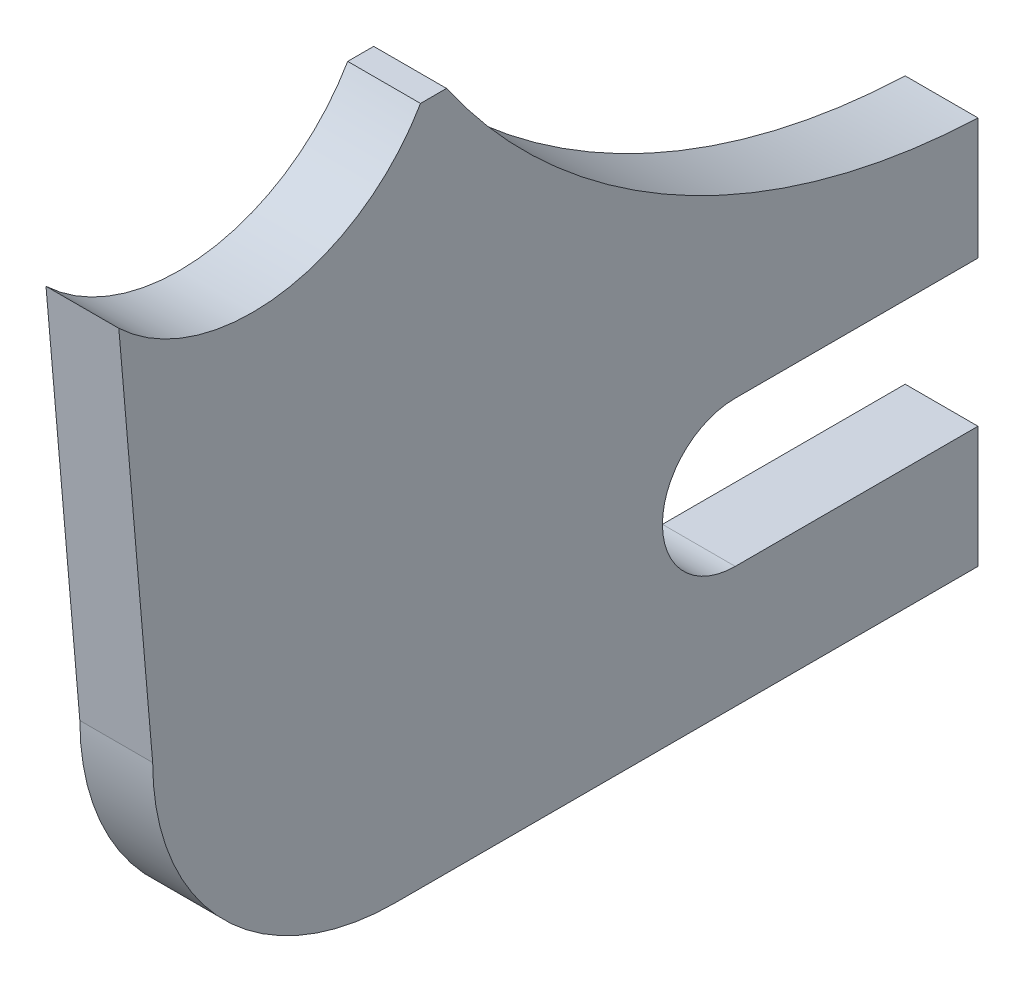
ISO-10303-21;
HEADER;
FILE_DESCRIPTION(('STEP AP214'),'2;1');
FILE_NAME('part.step','',(''),(''),'','','');
FILE_SCHEMA(('AUTOMOTIVE_DESIGN { 1 0 10303 214 1 1 1 1 }'));
ENDSEC;
DATA;
#1=APPLICATION_CONTEXT('core data for automotive mechanical design processes');
#2=APPLICATION_PROTOCOL_DEFINITION('international standard','automotive_design',2000,#1);
#3=PRODUCT_CONTEXT('',#1,'mechanical');
#4=PRODUCT('Part','Part','',(#3));
#5=PRODUCT_RELATED_PRODUCT_CATEGORY('part','',(#4));
#6=PRODUCT_DEFINITION_FORMATION('','',#4);
#7=PRODUCT_DEFINITION_CONTEXT('part definition',#1,'design');
#8=PRODUCT_DEFINITION('design','',#6,#7);
#9=PRODUCT_DEFINITION_SHAPE('','',#8);
#10=(LENGTH_UNIT() NAMED_UNIT(*) SI_UNIT(.MILLI.,.METRE.));
#11=(NAMED_UNIT(*) PLANE_ANGLE_UNIT() SI_UNIT($,.RADIAN.));
#12=(NAMED_UNIT(*) SI_UNIT($,.STERADIAN.) SOLID_ANGLE_UNIT());
#13=UNCERTAINTY_MEASURE_WITH_UNIT(LENGTH_MEASURE(1.E-05),#10,'distance_accuracy_value','');
#14=(GEOMETRIC_REPRESENTATION_CONTEXT(3) GLOBAL_UNCERTAINTY_ASSIGNED_CONTEXT((#13)) GLOBAL_UNIT_ASSIGNED_CONTEXT((#10,
#11,#12)) REPRESENTATION_CONTEXT('',''));
#15=CARTESIAN_POINT('',(0.,0.,0.));
#16=DIRECTION('',(0.,0.,1.));
#17=DIRECTION('',(1.,0.,0.));
#18=AXIS2_PLACEMENT_3D('',#15,#16,#17);
#19=CARTESIAN_POINT('',(190.5,1397.,374.32502182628));
#20=DIRECTION('',(-1.,0.,0.));
#21=DIRECTION('',(0.,0.,1.));
#22=AXIS2_PLACEMENT_3D('',#19,#20,#21);
#23=CYLINDRICAL_SURFACE('',#22,508.);
#24=CARTESIAN_POINT('',(0.,1397.,374.32502182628));
#25=DIRECTION('',(1.,0.,0.));
#26=DIRECTION('',(0.,0.,-1.));
#27=AXIS2_PLACEMENT_3D('',#24,#25,#26);
#28=CIRCLE('',#27,508.);
#29=CARTESIAN_POINT('',(0.,1028.07373018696,723.54902936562));
#30=VERTEX_POINT('',#29);
#31=CARTESIAN_POINT('',(0.,1143.,-65.6158832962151));
#32=VERTEX_POINT('',#31);
#33=EDGE_CURVE('E146',#30,#32,#28,.T.);
#34=ORIENTED_EDGE('',*,*,#33,.F.);
#35=DIRECTION('',(-1.,0.,0.));
#36=VECTOR('',#35,1.);
#37=CARTESIAN_POINT('',(190.5,1028.07373018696,723.54902936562));
#38=LINE('',#37,#36);
#39=CARTESIAN_POINT('',(190.5,1028.07373018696,723.54902936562));
#40=VERTEX_POINT('',#39);
#41=EDGE_CURVE('E11',#40,#30,#38,.T.);
#42=ORIENTED_EDGE('',*,*,#41,.F.);
#43=CARTESIAN_POINT('',(190.5,1397.,374.32502182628));
#44=DIRECTION('',(1.,0.,0.));
#45=DIRECTION('',(0.,0.,-1.));
#46=AXIS2_PLACEMENT_3D('',#43,#44,#45);
#47=CIRCLE('',#46,508.);
#48=CARTESIAN_POINT('',(190.5,1143.,-65.6158832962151));
#49=VERTEX_POINT('',#48);
#50=EDGE_CURVE('E171',#40,#49,#47,.T.);
#51=ORIENTED_EDGE('',*,*,#50,.T.);
#52=DIRECTION('',(-1.,0.,0.));
#53=VECTOR('',#52,1.);
#54=CARTESIAN_POINT('',(190.5,1143.,-65.6158832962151));
#55=LINE('',#54,#53);
#56=EDGE_CURVE('E93',#49,#32,#55,.T.);
#57=ORIENTED_EDGE('',*,*,#56,.T.);
#58=EDGE_LOOP('',(#34,#42,#51,#57));
#59=FACE_BOUND('',#58,.T.);
#60=ADVANCED_FACE('F34',(#59),#23,.F.);
#61=CARTESIAN_POINT('',(190.5,-54.2904353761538,630.323909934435));
#62=DIRECTION('',(0.,-0.0858132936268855,0.996311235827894));
#63=DIRECTION('',(0.,-0.996311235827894,-0.0858132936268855));
#64=AXIS2_PLACEMENT_3D('',#61,#62,#63);
#65=PLANE('',#64);
#66=DIRECTION('',(0.,0.996311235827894,0.0858132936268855));
#67=VECTOR('',#66,1.);
#68=CARTESIAN_POINT('',(0.,-54.2904353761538,630.323909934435));
#69=LINE('',#68,#67);
#70=CARTESIAN_POINT('',(0.,0.,635.));
#71=VERTEX_POINT('',#70);
#72=EDGE_CURVE('E149',#71,#30,#69,.T.);
#73=ORIENTED_EDGE('',*,*,#72,.F.);
#74=DIRECTION('',(-1.,0.,0.));
#75=VECTOR('',#74,1.);
#76=CARTESIAN_POINT('',(190.5,0.,635.));
#77=LINE('',#76,#75);
#78=CARTESIAN_POINT('',(190.5,0.,635.));
#79=VERTEX_POINT('',#78);
#80=EDGE_CURVE('E42',#79,#71,#77,.T.);
#81=ORIENTED_EDGE('',*,*,#80,.F.);
#82=DIRECTION('',(0.,0.996311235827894,0.0858132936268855));
#83=VECTOR('',#82,1.);
#84=CARTESIAN_POINT('',(190.5,-54.2904353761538,630.323909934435));
#85=LINE('',#84,#83);
#86=EDGE_CURVE('E202',#79,#40,#85,.T.);
#87=ORIENTED_EDGE('',*,*,#86,.T.);
#88=ORIENTED_EDGE('',*,*,#41,.T.);
#89=EDGE_LOOP('',(#73,#81,#87,#88));
#90=FACE_BOUND('',#89,.T.);
#91=ADVANCED_FACE('F201',(#90),#65,.T.);
#92=CARTESIAN_POINT('',(190.5,0.,0.));
#93=DIRECTION('',(-1.,0.,0.));
#94=DIRECTION('',(0.,0.,1.));
#95=AXIS2_PLACEMENT_3D('',#92,#93,#94);
#96=CYLINDRICAL_SURFACE('',#95,635.);
#97=CARTESIAN_POINT('',(0.,0.,0.));
#98=DIRECTION('',(1.,0.,0.));
#99=DIRECTION('',(0.,0.,-1.));
#100=AXIS2_PLACEMENT_3D('',#97,#98,#99);
#101=CIRCLE('',#100,635.);
#102=CARTESIAN_POINT('',(0.,-635.,0.));
#103=VERTEX_POINT('',#102);
#104=EDGE_CURVE('E152',#71,#103,#101,.T.);
#105=ORIENTED_EDGE('',*,*,#104,.T.);
#106=DIRECTION('',(-1.,0.,0.));
#107=VECTOR('',#106,1.);
#108=CARTESIAN_POINT('',(190.5,-635.,0.));
#109=LINE('',#108,#107);
#110=CARTESIAN_POINT('',(190.5,-635.,0.));
#111=VERTEX_POINT('',#110);
#112=EDGE_CURVE('E185',#111,#103,#109,.T.);
#113=ORIENTED_EDGE('',*,*,#112,.F.);
#114=CARTESIAN_POINT('',(190.5,0.,0.));
#115=DIRECTION('',(1.,0.,0.));
#116=DIRECTION('',(0.,0.,-1.));
#117=AXIS2_PLACEMENT_3D('',#114,#115,#116);
#118=CIRCLE('',#117,635.);
#119=EDGE_CURVE('E192',#79,#111,#118,.T.);
#120=ORIENTED_EDGE('',*,*,#119,.F.);
#121=ORIENTED_EDGE('',*,*,#80,.T.);
#122=EDGE_LOOP('',(#105,#113,#120,#121));
#123=FACE_BOUND('',#122,.T.);
#124=ADVANCED_FACE('F190',(#123),#96,.T.);
#125=CARTESIAN_POINT('',(190.5,-635.,0.));
#126=DIRECTION('',(0.,1.,0.));
#127=DIRECTION('',(0.,0.,1.));
#128=AXIS2_PLACEMENT_3D('',#125,#126,#127);
#129=PLANE('',#128);
#130=DIRECTION('',(0.,0.,-1.));
#131=VECTOR('',#130,1.);
#132=CARTESIAN_POINT('',(0.,-635.,0.));
#133=LINE('',#132,#131);
#134=CARTESIAN_POINT('',(0.,-635.,-1524.));
#135=VERTEX_POINT('',#134);
#136=EDGE_CURVE('E154',#103,#135,#133,.T.);
#137=ORIENTED_EDGE('',*,*,#136,.T.);
#138=DIRECTION('',(-1.,0.,0.));
#139=VECTOR('',#138,1.);
#140=CARTESIAN_POINT('',(190.5,-635.,-1524.));
#141=LINE('',#140,#139);
#142=CARTESIAN_POINT('',(190.5,-635.,-1524.));
#143=VERTEX_POINT('',#142);
#144=EDGE_CURVE('E182',#143,#135,#141,.T.);
#145=ORIENTED_EDGE('',*,*,#144,.F.);
#146=DIRECTION('',(0.,0.,-1.));
#147=VECTOR('',#146,1.);
#148=CARTESIAN_POINT('',(190.5,-635.,0.));
#149=LINE('',#148,#147);
#150=EDGE_CURVE('E208',#111,#143,#149,.T.);
#151=ORIENTED_EDGE('',*,*,#150,.F.);
#152=ORIENTED_EDGE('',*,*,#112,.T.);
#153=EDGE_LOOP('',(#137,#145,#151,#152));
#154=FACE_BOUND('',#153,.T.);
#155=ADVANCED_FACE('F244',(#154),#129,.F.);
#156=CARTESIAN_POINT('',(190.5,0.,-1524.));
#157=DIRECTION('',(0.,0.,1.));
#158=DIRECTION('',(1.,0.,0.));
#159=AXIS2_PLACEMENT_3D('',#156,#157,#158);
#160=PLANE('',#159);
#161=DIRECTION('',(0.,1.,0.));
#162=VECTOR('',#161,1.);
#163=CARTESIAN_POINT('',(0.,0.,-1524.));
#164=LINE('',#163,#162);
#165=CARTESIAN_POINT('',(0.,-317.5,-1524.));
#166=VERTEX_POINT('',#165);
#167=EDGE_CURVE('E156',#135,#166,#164,.T.);
#168=ORIENTED_EDGE('',*,*,#167,.T.);
#169=DIRECTION('',(-1.,0.,0.));
#170=VECTOR('',#169,1.);
#171=CARTESIAN_POINT('',(190.5,-317.5,-1524.));
#172=LINE('',#171,#170);
#173=CARTESIAN_POINT('',(190.5,-317.5,-1524.));
#174=VERTEX_POINT('',#173);
#175=EDGE_CURVE('E179',#174,#166,#172,.T.);
#176=ORIENTED_EDGE('',*,*,#175,.F.);
#177=DIRECTION('',(0.,1.,0.));
#178=VECTOR('',#177,1.);
#179=CARTESIAN_POINT('',(190.5,0.,-1524.));
#180=LINE('',#179,#178);
#181=EDGE_CURVE('E210',#143,#174,#180,.T.);
#182=ORIENTED_EDGE('',*,*,#181,.F.);
#183=ORIENTED_EDGE('',*,*,#144,.T.);
#184=EDGE_LOOP('',(#168,#176,#182,#183));
#185=FACE_BOUND('',#184,.T.);
#186=ADVANCED_FACE('F249',(#185),#160,.F.);
#187=CARTESIAN_POINT('',(190.5,-317.5,0.));
#188=DIRECTION('',(0.,-1.,0.));
#189=DIRECTION('',(0.,0.,-1.));
#190=AXIS2_PLACEMENT_3D('',#187,#188,#189);
#191=PLANE('',#190);
#192=DIRECTION('',(0.,0.,1.));
#193=VECTOR('',#192,1.);
#194=CARTESIAN_POINT('',(0.,-317.5,0.));
#195=LINE('',#194,#193);
#196=CARTESIAN_POINT('',(0.,-317.5,-889.));
#197=VERTEX_POINT('',#196);
#198=EDGE_CURVE('E158',#166,#197,#195,.T.);
#199=ORIENTED_EDGE('',*,*,#198,.T.);
#200=DIRECTION('',(-1.,0.,0.));
#201=VECTOR('',#200,1.);
#202=CARTESIAN_POINT('',(190.5,-317.5,-889.));
#203=LINE('',#202,#201);
#204=CARTESIAN_POINT('',(190.5,-317.5,-889.));
#205=VERTEX_POINT('',#204);
#206=EDGE_CURVE('E177',#205,#197,#203,.T.);
#207=ORIENTED_EDGE('',*,*,#206,.F.);
#208=DIRECTION('',(0.,0.,1.));
#209=VECTOR('',#208,1.);
#210=CARTESIAN_POINT('',(190.5,-317.5,0.));
#211=LINE('',#210,#209);
#212=EDGE_CURVE('E212',#174,#205,#211,.T.);
#213=ORIENTED_EDGE('',*,*,#212,.F.);
#214=ORIENTED_EDGE('',*,*,#175,.T.);
#215=EDGE_LOOP('',(#199,#207,#213,#214));
#216=FACE_BOUND('',#215,.T.);
#217=ADVANCED_FACE('F224',(#216),#191,.F.);
#218=CARTESIAN_POINT('',(190.5,-127.,-889.));
#219=DIRECTION('',(-1.,0.,0.));
#220=DIRECTION('',(0.,0.,1.));
#221=AXIS2_PLACEMENT_3D('',#218,#219,#220);
#222=CYLINDRICAL_SURFACE('',#221,190.5);
#223=CARTESIAN_POINT('',(0.,-127.,-889.));
#224=DIRECTION('',(1.,0.,0.));
#225=DIRECTION('',(0.,0.,-1.));
#226=AXIS2_PLACEMENT_3D('',#223,#224,#225);
#227=CIRCLE('',#226,190.5);
#228=CARTESIAN_POINT('',(0.,63.4999999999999,-889.));
#229=VERTEX_POINT('',#228);
#230=EDGE_CURVE('E161',#229,#197,#227,.T.);
#231=ORIENTED_EDGE('',*,*,#230,.F.);
#232=DIRECTION('',(-1.,0.,0.));
#233=VECTOR('',#232,1.);
#234=CARTESIAN_POINT('',(190.5,63.4999999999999,-889.));
#235=LINE('',#234,#233);
#236=CARTESIAN_POINT('',(190.5,63.4999999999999,-889.));
#237=VERTEX_POINT('',#236);
#238=EDGE_CURVE('E175',#237,#229,#235,.T.);
#239=ORIENTED_EDGE('',*,*,#238,.F.);
#240=CARTESIAN_POINT('',(190.5,-127.,-889.));
#241=DIRECTION('',(1.,0.,0.));
#242=DIRECTION('',(0.,0.,-1.));
#243=AXIS2_PLACEMENT_3D('',#240,#241,#242);
#244=CIRCLE('',#243,190.5);
#245=EDGE_CURVE('E214',#237,#205,#244,.T.);
#246=ORIENTED_EDGE('',*,*,#245,.T.);
#247=ORIENTED_EDGE('',*,*,#206,.T.);
#248=EDGE_LOOP('',(#231,#239,#246,#247));
#249=FACE_BOUND('',#248,.T.);
#250=ADVANCED_FACE('F218',(#249),#222,.F.);
#251=CARTESIAN_POINT('',(190.5,63.4999999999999,0.));
#252=DIRECTION('',(0.,1.,0.));
#253=DIRECTION('',(0.,0.,1.));
#254=AXIS2_PLACEMENT_3D('',#251,#252,#253);
#255=PLANE('',#254);
#256=DIRECTION('',(0.,0.,-1.));
#257=VECTOR('',#256,1.);
#258=CARTESIAN_POINT('',(0.,63.4999999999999,0.));
#259=LINE('',#258,#257);
#260=CARTESIAN_POINT('',(0.,63.4999999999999,-1524.));
#261=VERTEX_POINT('',#260);
#262=EDGE_CURVE('E164',#229,#261,#259,.T.);
#263=ORIENTED_EDGE('',*,*,#262,.T.);
#264=DIRECTION('',(-1.,0.,0.));
#265=VECTOR('',#264,1.);
#266=CARTESIAN_POINT('',(190.5,63.4999999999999,-1524.));
#267=LINE('',#266,#265);
#268=CARTESIAN_POINT('',(190.5,63.4999999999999,-1524.));
#269=VERTEX_POINT('',#268);
#270=EDGE_CURVE('E139',#269,#261,#267,.T.);
#271=ORIENTED_EDGE('',*,*,#270,.F.);
#272=DIRECTION('',(0.,0.,-1.));
#273=VECTOR('',#272,1.);
#274=CARTESIAN_POINT('',(190.5,63.4999999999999,0.));
#275=LINE('',#274,#273);
#276=EDGE_CURVE('E126',#237,#269,#275,.T.);
#277=ORIENTED_EDGE('',*,*,#276,.F.);
#278=ORIENTED_EDGE('',*,*,#238,.T.);
#279=EDGE_LOOP('',(#263,#271,#277,#278));
#280=FACE_BOUND('',#279,.T.);
#281=ADVANCED_FACE('F228',(#280),#255,.F.);
#282=CARTESIAN_POINT('',(190.5,0.,-1524.));
#283=DIRECTION('',(0.,0.,1.));
#284=DIRECTION('',(1.,0.,0.));
#285=AXIS2_PLACEMENT_3D('',#282,#283,#284);
#286=PLANE('',#285);
#287=DIRECTION('',(0.,1.,0.));
#288=VECTOR('',#287,1.);
#289=CARTESIAN_POINT('',(0.,0.,-1524.));
#290=LINE('',#289,#288);
#291=CARTESIAN_POINT('',(0.,381.,-1524.));
#292=VERTEX_POINT('',#291);
#293=EDGE_CURVE('E135',#261,#292,#290,.T.);
#294=ORIENTED_EDGE('',*,*,#293,.T.);
#295=DIRECTION('',(-1.,0.,0.));
#296=VECTOR('',#295,1.);
#297=CARTESIAN_POINT('',(190.5,381.,-1524.));
#298=LINE('',#297,#296);
#299=CARTESIAN_POINT('',(190.5,381.,-1524.));
#300=VERTEX_POINT('',#299);
#301=EDGE_CURVE('E132',#300,#292,#298,.T.);
#302=ORIENTED_EDGE('',*,*,#301,.F.);
#303=DIRECTION('',(0.,1.,0.));
#304=VECTOR('',#303,1.);
#305=CARTESIAN_POINT('',(190.5,0.,-1524.));
#306=LINE('',#305,#304);
#307=EDGE_CURVE('E119',#269,#300,#306,.T.);
#308=ORIENTED_EDGE('',*,*,#307,.F.);
#309=ORIENTED_EDGE('',*,*,#270,.T.);
#310=EDGE_LOOP('',(#294,#302,#308,#309));
#311=FACE_BOUND('',#310,.T.);
#312=ADVANCED_FACE('F133',(#311),#286,.F.);
#313=CARTESIAN_POINT('',(190.5,2157.63150900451,-1593.74583293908));
#314=DIRECTION('',(-1.,0.,0.));
#315=DIRECTION('',(0.,0.,1.));
#316=AXIS2_PLACEMENT_3D('',#313,#314,#315);
#317=CYLINDRICAL_SURFACE('',#316,1778.);
#318=CARTESIAN_POINT('',(0.,2157.63150900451,-1593.74583293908));
#319=DIRECTION('',(1.,0.,0.));
#320=DIRECTION('',(0.,0.,-1.));
#321=AXIS2_PLACEMENT_3D('',#318,#319,#320);
#322=CIRCLE('',#321,1778.);
#323=CARTESIAN_POINT('',(0.,1143.,-133.67497817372));
#324=VERTEX_POINT('',#323);
#325=EDGE_CURVE('E167',#324,#292,#322,.T.);
#326=ORIENTED_EDGE('',*,*,#325,.F.);
#327=DIRECTION('',(-1.,0.,0.));
#328=VECTOR('',#327,1.);
#329=CARTESIAN_POINT('',(190.5,1143.,-133.67497817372));
#330=LINE('',#329,#328);
#331=CARTESIAN_POINT('',(190.5,1143.,-133.67497817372));
#332=VERTEX_POINT('',#331);
#333=EDGE_CURVE('E86',#332,#324,#330,.T.);
#334=ORIENTED_EDGE('',*,*,#333,.F.);
#335=CARTESIAN_POINT('',(190.5,2157.63150900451,-1593.74583293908));
#336=DIRECTION('',(1.,0.,0.));
#337=DIRECTION('',(0.,0.,-1.));
#338=AXIS2_PLACEMENT_3D('',#335,#336,#337);
#339=CIRCLE('',#338,1778.);
#340=EDGE_CURVE('E123',#332,#300,#339,.T.);
#341=ORIENTED_EDGE('',*,*,#340,.T.);
#342=ORIENTED_EDGE('',*,*,#301,.T.);
#343=EDGE_LOOP('',(#326,#334,#341,#342));
#344=FACE_BOUND('',#343,.T.);
#345=ADVANCED_FACE('F141',(#344),#317,.F.);
#346=CARTESIAN_POINT('',(190.5,1143.,0.));
#347=DIRECTION('',(0.,-1.,0.));
#348=DIRECTION('',(0.,0.,-1.));
#349=AXIS2_PLACEMENT_3D('',#346,#347,#348);
#350=PLANE('',#349);
#351=DIRECTION('',(0.,0.,1.));
#352=VECTOR('',#351,1.);
#353=CARTESIAN_POINT('',(0.,1143.,0.));
#354=LINE('',#353,#352);
#355=EDGE_CURVE('E169',#324,#32,#354,.T.);
#356=ORIENTED_EDGE('',*,*,#355,.T.);
#357=ORIENTED_EDGE('',*,*,#56,.F.);
#358=DIRECTION('',(0.,0.,1.));
#359=VECTOR('',#358,1.);
#360=CARTESIAN_POINT('',(190.5,1143.,0.));
#361=LINE('',#360,#359);
#362=EDGE_CURVE('E50',#332,#49,#361,.T.);
#363=ORIENTED_EDGE('',*,*,#362,.F.);
#364=ORIENTED_EDGE('',*,*,#333,.T.);
#365=EDGE_LOOP('',(#356,#357,#363,#364));
#366=FACE_BOUND('',#365,.T.);
#367=ADVANCED_FACE('F203',(#366),#350,.F.);
#368=CARTESIAN_POINT('',(190.5,0.,0.));
#369=DIRECTION('',(1.,0.,0.));
#370=DIRECTION('',(0.,0.,-1.));
#371=AXIS2_PLACEMENT_3D('',#368,#369,#370);
#372=PLANE('',#371);
#373=ORIENTED_EDGE('',*,*,#50,.F.);
#374=ORIENTED_EDGE('',*,*,#86,.F.);
#375=ORIENTED_EDGE('',*,*,#119,.T.);
#376=ORIENTED_EDGE('',*,*,#150,.T.);
#377=ORIENTED_EDGE('',*,*,#181,.T.);
#378=ORIENTED_EDGE('',*,*,#212,.T.);
#379=ORIENTED_EDGE('',*,*,#245,.F.);
#380=ORIENTED_EDGE('',*,*,#276,.T.);
#381=ORIENTED_EDGE('',*,*,#307,.T.);
#382=ORIENTED_EDGE('',*,*,#340,.F.);
#383=ORIENTED_EDGE('',*,*,#362,.T.);
#384=EDGE_LOOP('',(#373,#374,#375,#376,#377,#378,#379,#380,#381,#382,#383));
#385=FACE_BOUND('',#384,.T.);
#386=ADVANCED_FACE('F121',(#385),#372,.T.);
#387=CARTESIAN_POINT('',(0.,0.,0.));
#388=DIRECTION('',(1.,0.,0.));
#389=DIRECTION('',(0.,0.,-1.));
#390=AXIS2_PLACEMENT_3D('',#387,#388,#389);
#391=PLANE('',#390);
#392=ORIENTED_EDGE('',*,*,#33,.T.);
#393=ORIENTED_EDGE('',*,*,#355,.F.);
#394=ORIENTED_EDGE('',*,*,#325,.T.);
#395=ORIENTED_EDGE('',*,*,#293,.F.);
#396=ORIENTED_EDGE('',*,*,#262,.F.);
#397=ORIENTED_EDGE('',*,*,#230,.T.);
#398=ORIENTED_EDGE('',*,*,#198,.F.);
#399=ORIENTED_EDGE('',*,*,#167,.F.);
#400=ORIENTED_EDGE('',*,*,#136,.F.);
#401=ORIENTED_EDGE('',*,*,#104,.F.);
#402=ORIENTED_EDGE('',*,*,#72,.T.);
#403=EDGE_LOOP('',(#392,#393,#394,#395,#396,#397,#398,#399,#400,#401,#402));
#404=FACE_BOUND('',#403,.T.);
#405=ADVANCED_FACE('F199',(#404),#391,.F.);
#406=CLOSED_SHELL('',(#60,#91,#124,#155,#186,#217,#250,#281,#312,#345,#367,#386,#405));
#407=MANIFOLD_SOLID_BREP('B2',#406);
#408=ADVANCED_BREP_SHAPE_REPRESENTATION('',(#18,#407),#14);
#409=SHAPE_DEFINITION_REPRESENTATION(#9,#408);
ENDSEC;
END-ISO-10303-21;
